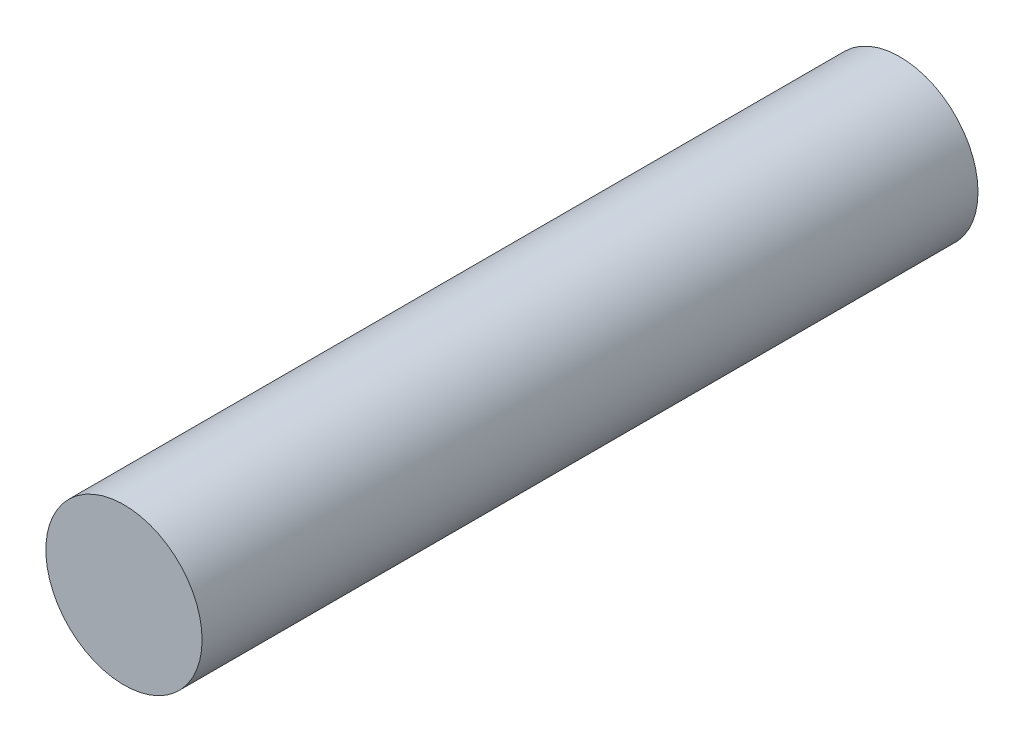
ISO-10303-21;
HEADER;
FILE_DESCRIPTION(('STEP AP214'),'2;1');
FILE_NAME('part.step','',(''),(''),'','','');
FILE_SCHEMA(('AUTOMOTIVE_DESIGN { 1 0 10303 214 1 1 1 1 }'));
ENDSEC;
DATA;
#1=APPLICATION_CONTEXT('core data for automotive mechanical design processes');
#2=APPLICATION_PROTOCOL_DEFINITION('international standard','automotive_design',2000,#1);
#3=PRODUCT_CONTEXT('',#1,'mechanical');
#4=PRODUCT('Part','Part','',(#3));
#5=PRODUCT_RELATED_PRODUCT_CATEGORY('part','',(#4));
#6=PRODUCT_DEFINITION_FORMATION('','',#4);
#7=PRODUCT_DEFINITION_CONTEXT('part definition',#1,'design');
#8=PRODUCT_DEFINITION('design','',#6,#7);
#9=PRODUCT_DEFINITION_SHAPE('','',#8);
#10=(LENGTH_UNIT() NAMED_UNIT(*) SI_UNIT(.MILLI.,.METRE.));
#11=(NAMED_UNIT(*) PLANE_ANGLE_UNIT() SI_UNIT($,.RADIAN.));
#12=(NAMED_UNIT(*) SI_UNIT($,.STERADIAN.) SOLID_ANGLE_UNIT());
#13=UNCERTAINTY_MEASURE_WITH_UNIT(LENGTH_MEASURE(1.E-05),#10,'distance_accuracy_value','');
#14=(GEOMETRIC_REPRESENTATION_CONTEXT(3) GLOBAL_UNCERTAINTY_ASSIGNED_CONTEXT((#13)) GLOBAL_UNIT_ASSIGNED_CONTEXT((#10,
#11,#12)) REPRESENTATION_CONTEXT('',''));
#15=CARTESIAN_POINT('',(0.,0.,0.));
#16=DIRECTION('',(0.,0.,1.));
#17=DIRECTION('',(1.,0.,0.));
#18=AXIS2_PLACEMENT_3D('',#15,#16,#17);
#19=CARTESIAN_POINT('',(0.,0.,372.5));
#20=DIRECTION('',(0.,0.,-1.));
#21=DIRECTION('',(-1.,0.,0.));
#22=AXIS2_PLACEMENT_3D('',#19,#20,#21);
#23=CYLINDRICAL_SURFACE('',#22,75.);
#24=CARTESIAN_POINT('',(0.,0.,372.5));
#25=DIRECTION('',(0.,0.,1.));
#26=DIRECTION('',(1.,0.,0.));
#27=AXIS2_PLACEMENT_3D('',#24,#25,#26);
#28=CIRCLE('',#27,75.);
#29=CARTESIAN_POINT('',(75.,0.,372.5));
#30=VERTEX_POINT('',#29);
#31=EDGE_CURVE('E10',#30,#30,#28,.T.);
#32=ORIENTED_EDGE('',*,*,#31,.F.);
#33=EDGE_LOOP('',(#32));
#34=FACE_BOUND('',#33,.T.);
#35=CARTESIAN_POINT('',(0.,0.,-372.5));
#36=DIRECTION('',(0.,0.,1.));
#37=DIRECTION('',(1.,0.,0.));
#38=AXIS2_PLACEMENT_3D('',#35,#36,#37);
#39=CIRCLE('',#38,75.);
#40=CARTESIAN_POINT('',(75.,0.,-372.5));
#41=VERTEX_POINT('',#40);
#42=EDGE_CURVE('E33',#41,#41,#39,.T.);
#43=ORIENTED_EDGE('',*,*,#42,.T.);
#44=EDGE_LOOP('',(#43));
#45=FACE_BOUND('',#44,.T.);
#46=ADVANCED_FACE('F30',(#34,#45),#23,.T.);
#47=CARTESIAN_POINT('',(0.,0.,372.5));
#48=DIRECTION('',(0.,0.,1.));
#49=DIRECTION('',(1.,0.,0.));
#50=AXIS2_PLACEMENT_3D('',#47,#48,#49);
#51=PLANE('',#50);
#52=ORIENTED_EDGE('',*,*,#31,.T.);
#53=EDGE_LOOP('',(#52));
#54=FACE_BOUND('',#53,.T.);
#55=ADVANCED_FACE('F45',(#54),#51,.T.);
#56=CARTESIAN_POINT('',(0.,0.,-372.5));
#57=DIRECTION('',(0.,0.,1.));
#58=DIRECTION('',(1.,0.,0.));
#59=AXIS2_PLACEMENT_3D('',#56,#57,#58);
#60=PLANE('',#59);
#61=ORIENTED_EDGE('',*,*,#42,.F.);
#62=EDGE_LOOP('',(#61));
#63=FACE_BOUND('',#62,.T.);
#64=ADVANCED_FACE('F43',(#63),#60,.F.);
#65=CLOSED_SHELL('',(#46,#55,#64));
#66=MANIFOLD_SOLID_BREP('B2',#65);
#67=ADVANCED_BREP_SHAPE_REPRESENTATION('',(#18,#66),#14);
#68=SHAPE_DEFINITION_REPRESENTATION(#9,#67);
ENDSEC;
END-ISO-10303-21;
